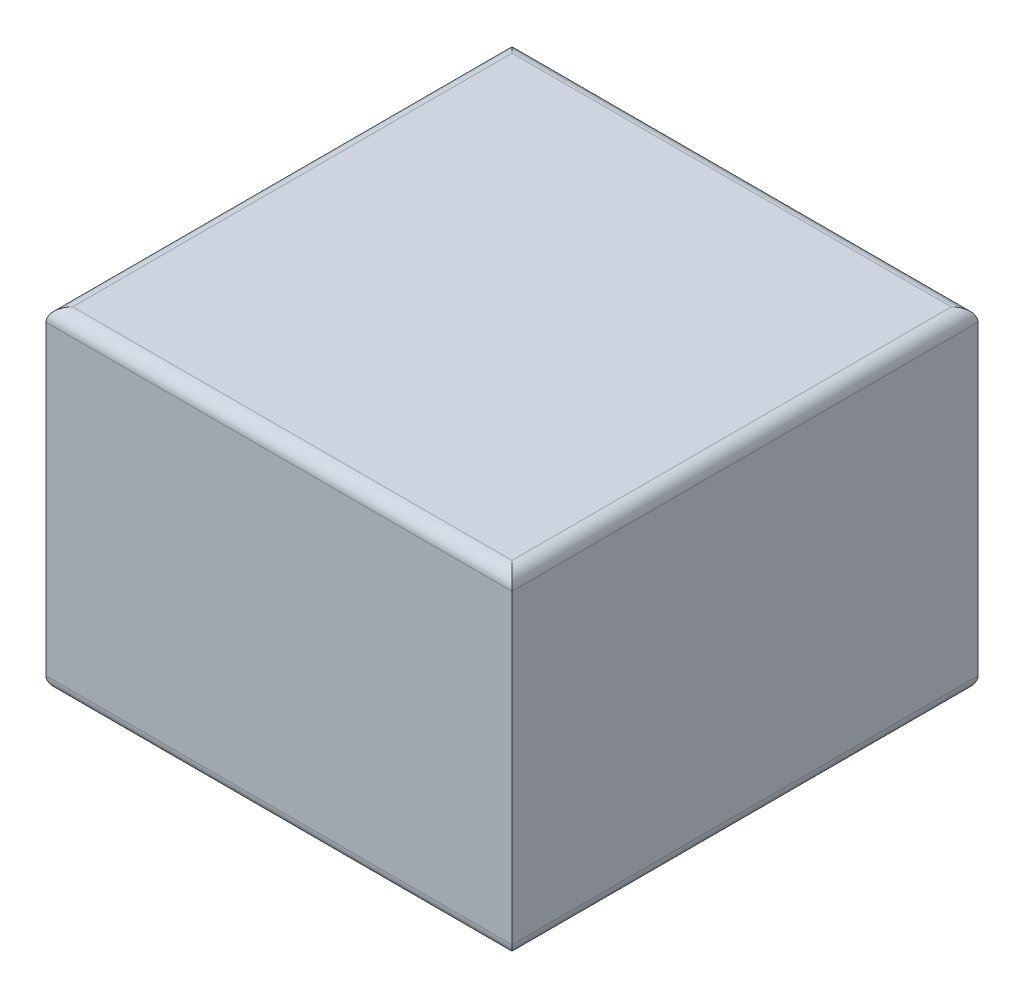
ISO-10303-21;
HEADER;
FILE_DESCRIPTION(('STEP AP214'),'2;1');
FILE_NAME('part.step','',(''),(''),'','','');
FILE_SCHEMA(('AUTOMOTIVE_DESIGN { 1 0 10303 214 1 1 1 1 }'));
ENDSEC;
DATA;
#1=APPLICATION_CONTEXT('core data for automotive mechanical design processes');
#2=APPLICATION_PROTOCOL_DEFINITION('international standard','automotive_design',2000,#1);
#3=PRODUCT_CONTEXT('',#1,'mechanical');
#4=PRODUCT('Part','Part','',(#3));
#5=PRODUCT_RELATED_PRODUCT_CATEGORY('part','',(#4));
#6=PRODUCT_DEFINITION_FORMATION('','',#4);
#7=PRODUCT_DEFINITION_CONTEXT('part definition',#1,'design');
#8=PRODUCT_DEFINITION('design','',#6,#7);
#9=PRODUCT_DEFINITION_SHAPE('','',#8);
#10=(LENGTH_UNIT() NAMED_UNIT(*) SI_UNIT(.MILLI.,.METRE.));
#11=(NAMED_UNIT(*) PLANE_ANGLE_UNIT() SI_UNIT($,.RADIAN.));
#12=(NAMED_UNIT(*) SI_UNIT($,.STERADIAN.) SOLID_ANGLE_UNIT());
#13=UNCERTAINTY_MEASURE_WITH_UNIT(LENGTH_MEASURE(1.E-05),#10,'distance_accuracy_value','');
#14=(GEOMETRIC_REPRESENTATION_CONTEXT(3) GLOBAL_UNCERTAINTY_ASSIGNED_CONTEXT((#13)) GLOBAL_UNIT_ASSIGNED_CONTEXT((#10,
#11,#12)) REPRESENTATION_CONTEXT('',''));
#15=CARTESIAN_POINT('',(0.,0.,0.));
#16=DIRECTION('',(0.,0.,1.));
#17=DIRECTION('',(1.,0.,0.));
#18=AXIS2_PLACEMENT_3D('',#15,#16,#17);
#19=CARTESIAN_POINT('',(0.,25.,0.));
#20=DIRECTION('',(1.,0.,0.));
#21=DIRECTION('',(0.,0.,-1.));
#22=AXIS2_PLACEMENT_3D('',#19,#20,#21);
#23=PLANE('',#22);
#24=DIRECTION('',(0.,-1.,0.));
#25=VECTOR('',#24,1.);
#26=CARTESIAN_POINT('',(0.,25.,-35.));
#27=LINE('',#26,#25);
#28=CARTESIAN_POINT('',(0.,24.,-35.));
#29=VERTEX_POINT('',#28);
#30=CARTESIAN_POINT('',(0.,1.,-35.));
#31=VERTEX_POINT('',#30);
#32=EDGE_CURVE('E158',#29,#31,#27,.T.);
#33=ORIENTED_EDGE('',*,*,#32,.T.);
#34=DIRECTION('',(0.,0.,1.));
#35=VECTOR('',#34,1.);
#36=CARTESIAN_POINT('',(0.,1.,0.));
#37=LINE('',#36,#35);
#38=CARTESIAN_POINT('',(0.,1.,0.));
#39=VERTEX_POINT('',#38);
#40=EDGE_CURVE('E172',#31,#39,#37,.T.);
#41=ORIENTED_EDGE('',*,*,#40,.T.);
#42=DIRECTION('',(0.,-1.,0.));
#43=VECTOR('',#42,1.);
#44=CARTESIAN_POINT('',(0.,25.,0.));
#45=LINE('',#44,#43);
#46=CARTESIAN_POINT('',(0.,24.,0.));
#47=VERTEX_POINT('',#46);
#48=EDGE_CURVE('E129',#47,#39,#45,.T.);
#49=ORIENTED_EDGE('',*,*,#48,.F.);
#50=DIRECTION('',(0.,0.,1.));
#51=VECTOR('',#50,1.);
#52=CARTESIAN_POINT('',(0.,24.,0.));
#53=LINE('',#52,#51);
#54=EDGE_CURVE('E175',#47,#29,#53,.F.);
#55=ORIENTED_EDGE('',*,*,#54,.T.);
#56=EDGE_LOOP('',(#33,#41,#49,#55));
#57=FACE_BOUND('',#56,.T.);
#58=ADVANCED_FACE('F39',(#57),#23,.F.);
#59=CARTESIAN_POINT('',(0.,25.,0.));
#60=DIRECTION('',(0.,0.,-1.));
#61=DIRECTION('',(-1.,0.,0.));
#62=AXIS2_PLACEMENT_3D('',#59,#60,#61);
#63=PLANE('',#62);
#64=ORIENTED_EDGE('',*,*,#48,.T.);
#65=DIRECTION('',(1.,0.,0.));
#66=VECTOR('',#65,1.);
#67=CARTESIAN_POINT('',(35.,1.,0.));
#68=LINE('',#67,#66);
#69=CARTESIAN_POINT('',(35.,1.,0.));
#70=VERTEX_POINT('',#69);
#71=EDGE_CURVE('E127',#39,#70,#68,.T.);
#72=ORIENTED_EDGE('',*,*,#71,.T.);
#73=DIRECTION('',(0.,-1.,0.));
#74=VECTOR('',#73,1.);
#75=CARTESIAN_POINT('',(35.,25.,0.));
#76=LINE('',#75,#74);
#77=CARTESIAN_POINT('',(35.,24.,0.));
#78=VERTEX_POINT('',#77);
#79=EDGE_CURVE('E109',#78,#70,#76,.T.);
#80=ORIENTED_EDGE('',*,*,#79,.F.);
#81=DIRECTION('',(1.,0.,0.));
#82=VECTOR('',#81,1.);
#83=CARTESIAN_POINT('',(0.,24.,0.));
#84=LINE('',#83,#82);
#85=EDGE_CURVE('E124',#78,#47,#84,.F.);
#86=ORIENTED_EDGE('',*,*,#85,.T.);
#87=EDGE_LOOP('',(#64,#72,#80,#86));
#88=FACE_BOUND('',#87,.T.);
#89=ADVANCED_FACE('F123',(#88),#63,.F.);
#90=CARTESIAN_POINT('',(35.,25.,0.));
#91=DIRECTION('',(-1.,0.,0.));
#92=DIRECTION('',(0.,0.,1.));
#93=AXIS2_PLACEMENT_3D('',#90,#91,#92);
#94=PLANE('',#93);
#95=ORIENTED_EDGE('',*,*,#79,.T.);
#96=DIRECTION('',(0.,0.,-1.));
#97=VECTOR('',#96,1.);
#98=CARTESIAN_POINT('',(35.,1.,-35.));
#99=LINE('',#98,#97);
#100=CARTESIAN_POINT('',(35.,1.,-35.));
#101=VERTEX_POINT('',#100);
#102=EDGE_CURVE('E116',#70,#101,#99,.T.);
#103=ORIENTED_EDGE('',*,*,#102,.T.);
#104=DIRECTION('',(0.,-1.,0.));
#105=VECTOR('',#104,1.);
#106=CARTESIAN_POINT('',(35.,25.,-35.));
#107=LINE('',#106,#105);
#108=CARTESIAN_POINT('',(35.,24.,-35.));
#109=VERTEX_POINT('',#108);
#110=EDGE_CURVE('E111',#109,#101,#107,.T.);
#111=ORIENTED_EDGE('',*,*,#110,.F.);
#112=DIRECTION('',(0.,0.,-1.));
#113=VECTOR('',#112,1.);
#114=CARTESIAN_POINT('',(35.,24.,0.));
#115=LINE('',#114,#113);
#116=EDGE_CURVE('E106',#109,#78,#115,.F.);
#117=ORIENTED_EDGE('',*,*,#116,.T.);
#118=EDGE_LOOP('',(#95,#103,#111,#117));
#119=FACE_BOUND('',#118,.T.);
#120=ADVANCED_FACE('F108',(#119),#94,.F.);
#121=CARTESIAN_POINT('',(0.,25.,-35.));
#122=DIRECTION('',(0.,0.,1.));
#123=DIRECTION('',(1.,0.,0.));
#124=AXIS2_PLACEMENT_3D('',#121,#122,#123);
#125=PLANE('',#124);
#126=ORIENTED_EDGE('',*,*,#110,.T.);
#127=DIRECTION('',(-1.,0.,0.));
#128=VECTOR('',#127,1.);
#129=CARTESIAN_POINT('',(0.,1.,-35.));
#130=LINE('',#129,#128);
#131=EDGE_CURVE('E178',#101,#31,#130,.T.);
#132=ORIENTED_EDGE('',*,*,#131,.T.);
#133=ORIENTED_EDGE('',*,*,#32,.F.);
#134=DIRECTION('',(-1.,0.,0.));
#135=VECTOR('',#134,1.);
#136=CARTESIAN_POINT('',(0.,24.,-35.));
#137=LINE('',#136,#135);
#138=EDGE_CURVE('E181',#29,#109,#137,.F.);
#139=ORIENTED_EDGE('',*,*,#138,.T.);
#140=EDGE_LOOP('',(#126,#132,#133,#139));
#141=FACE_BOUND('',#140,.T.);
#142=ADVANCED_FACE('F229',(#141),#125,.F.);
#143=CARTESIAN_POINT('',(0.,25.,0.));
#144=DIRECTION('',(0.,-1.,0.));
#145=DIRECTION('',(0.,0.,-1.));
#146=AXIS2_PLACEMENT_3D('',#143,#144,#145);
#147=PLANE('',#146);
#148=DIRECTION('',(0.,0.,-1.));
#149=VECTOR('',#148,1.);
#150=CARTESIAN_POINT('',(34.,25.,0.));
#151=LINE('',#150,#149);
#152=CARTESIAN_POINT('',(34.,25.,-1.));
#153=VERTEX_POINT('',#152);
#154=CARTESIAN_POINT('',(34.,25.,-34.));
#155=VERTEX_POINT('',#154);
#156=EDGE_CURVE('E49',#153,#155,#151,.T.);
#157=ORIENTED_EDGE('',*,*,#156,.T.);
#158=DIRECTION('',(-1.,0.,0.));
#159=VECTOR('',#158,1.);
#160=CARTESIAN_POINT('',(0.,25.,-34.));
#161=LINE('',#160,#159);
#162=CARTESIAN_POINT('',(1.,25.,-34.));
#163=VERTEX_POINT('',#162);
#164=EDGE_CURVE('E11',#155,#163,#161,.T.);
#165=ORIENTED_EDGE('',*,*,#164,.T.);
#166=DIRECTION('',(0.,0.,1.));
#167=VECTOR('',#166,1.);
#168=CARTESIAN_POINT('',(1.,25.,0.));
#169=LINE('',#168,#167);
#170=CARTESIAN_POINT('',(1.,25.,-1.));
#171=VERTEX_POINT('',#170);
#172=EDGE_CURVE('E169',#163,#171,#169,.T.);
#173=ORIENTED_EDGE('',*,*,#172,.T.);
#174=DIRECTION('',(1.,0.,0.));
#175=VECTOR('',#174,1.);
#176=CARTESIAN_POINT('',(0.,25.,-1.));
#177=LINE('',#176,#175);
#178=EDGE_CURVE('E60',#171,#153,#177,.T.);
#179=ORIENTED_EDGE('',*,*,#178,.T.);
#180=EDGE_LOOP('',(#157,#165,#173,#179));
#181=FACE_BOUND('',#180,.T.);
#182=ADVANCED_FACE('F235',(#181),#147,.F.);
#183=CARTESIAN_POINT('',(0.,0.,0.));
#184=DIRECTION('',(0.,-1.,0.));
#185=DIRECTION('',(0.,0.,-1.));
#186=AXIS2_PLACEMENT_3D('',#183,#184,#185);
#187=PLANE('',#186);
#188=DIRECTION('',(0.,0.,-1.));
#189=VECTOR('',#188,1.);
#190=CARTESIAN_POINT('',(34.,0.,0.));
#191=LINE('',#190,#189);
#192=CARTESIAN_POINT('',(34.,0.,-34.));
#193=VERTEX_POINT('',#192);
#194=CARTESIAN_POINT('',(34.,0.,-1.));
#195=VERTEX_POINT('',#194);
#196=EDGE_CURVE('E189',#193,#195,#191,.F.);
#197=ORIENTED_EDGE('',*,*,#196,.T.);
#198=DIRECTION('',(1.,0.,0.));
#199=VECTOR('',#198,1.);
#200=CARTESIAN_POINT('',(0.,0.,-1.));
#201=LINE('',#200,#199);
#202=CARTESIAN_POINT('',(1.,0.,-1.));
#203=VERTEX_POINT('',#202);
#204=EDGE_CURVE('E117',#195,#203,#201,.F.);
#205=ORIENTED_EDGE('',*,*,#204,.T.);
#206=DIRECTION('',(0.,0.,1.));
#207=VECTOR('',#206,1.);
#208=CARTESIAN_POINT('',(1.,0.,-35.));
#209=LINE('',#208,#207);
#210=CARTESIAN_POINT('',(1.,0.,-34.));
#211=VERTEX_POINT('',#210);
#212=EDGE_CURVE('E195',#203,#211,#209,.F.);
#213=ORIENTED_EDGE('',*,*,#212,.T.);
#214=DIRECTION('',(-1.,0.,0.));
#215=VECTOR('',#214,1.);
#216=CARTESIAN_POINT('',(35.,0.,-34.));
#217=LINE('',#216,#215);
#218=EDGE_CURVE('E192',#211,#193,#217,.F.);
#219=ORIENTED_EDGE('',*,*,#218,.T.);
#220=EDGE_LOOP('',(#197,#205,#213,#219));
#221=FACE_BOUND('',#220,.T.);
#222=ADVANCED_FACE('F237',(#221),#187,.T.);
#223=CARTESIAN_POINT('',(0.,1.,-34.));
#224=DIRECTION('',(1.,0.,0.));
#225=DIRECTION('',(0.,0.,-1.));
#226=AXIS2_PLACEMENT_3D('',#223,#224,#225);
#227=CYLINDRICAL_SURFACE('',#226,1.);
#228=CARTESIAN_POINT('',(34.,1.,-34.));
#229=DIRECTION('',(0.707106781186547,0.,0.707106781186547));
#230=DIRECTION('',(0.707106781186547,0.,-0.707106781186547));
#231=AXIS2_PLACEMENT_3D('',#228,#229,#230);
#232=ELLIPSE('',#231,1.41421356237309,1.);
#233=EDGE_CURVE('E159',#193,#101,#232,.T.);
#234=ORIENTED_EDGE('',*,*,#233,.F.);
#235=ORIENTED_EDGE('',*,*,#218,.F.);
#236=CARTESIAN_POINT('',(1.,1.,-34.));
#237=DIRECTION('',(0.707106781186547,0.,-0.707106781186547));
#238=DIRECTION('',(-0.707106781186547,0.,-0.707106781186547));
#239=AXIS2_PLACEMENT_3D('',#236,#237,#238);
#240=ELLIPSE('',#239,1.41421356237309,1.);
#241=EDGE_CURVE('E154',#31,#211,#240,.F.);
#242=ORIENTED_EDGE('',*,*,#241,.F.);
#243=ORIENTED_EDGE('',*,*,#131,.F.);
#244=EDGE_LOOP('',(#234,#235,#242,#243));
#245=FACE_BOUND('',#244,.T.);
#246=ADVANCED_FACE('F216',(#245),#227,.T.);
#247=CARTESIAN_POINT('',(1.,1.,0.));
#248=DIRECTION('',(0.,0.,-1.));
#249=DIRECTION('',(-1.,0.,0.));
#250=AXIS2_PLACEMENT_3D('',#247,#248,#249);
#251=CYLINDRICAL_SURFACE('',#250,1.);
#252=ORIENTED_EDGE('',*,*,#241,.T.);
#253=ORIENTED_EDGE('',*,*,#212,.F.);
#254=CARTESIAN_POINT('',(1.,1.,-1.));
#255=DIRECTION('',(-0.707106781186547,0.,-0.707106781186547));
#256=DIRECTION('',(0.707106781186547,0.,-0.707106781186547));
#257=AXIS2_PLACEMENT_3D('',#254,#255,#256);
#258=ELLIPSE('',#257,1.41421356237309,1.);
#259=EDGE_CURVE('E143',#39,#203,#258,.F.);
#260=ORIENTED_EDGE('',*,*,#259,.F.);
#261=ORIENTED_EDGE('',*,*,#40,.F.);
#262=EDGE_LOOP('',(#252,#253,#260,#261));
#263=FACE_BOUND('',#262,.T.);
#264=ADVANCED_FACE('F220',(#263),#251,.T.);
#265=CARTESIAN_POINT('',(34.,1.,0.));
#266=DIRECTION('',(0.,0.,1.));
#267=DIRECTION('',(1.,0.,0.));
#268=AXIS2_PLACEMENT_3D('',#265,#266,#267);
#269=CYLINDRICAL_SURFACE('',#268,1.);
#270=ORIENTED_EDGE('',*,*,#233,.T.);
#271=ORIENTED_EDGE('',*,*,#102,.F.);
#272=CARTESIAN_POINT('',(34.,1.,-1.));
#273=DIRECTION('',(-0.707106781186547,0.,0.707106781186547));
#274=DIRECTION('',(0.707106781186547,0.,0.707106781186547));
#275=AXIS2_PLACEMENT_3D('',#272,#273,#274);
#276=ELLIPSE('',#275,1.41421356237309,1.);
#277=EDGE_CURVE('E140',#195,#70,#276,.T.);
#278=ORIENTED_EDGE('',*,*,#277,.F.);
#279=ORIENTED_EDGE('',*,*,#196,.F.);
#280=EDGE_LOOP('',(#270,#271,#278,#279));
#281=FACE_BOUND('',#280,.T.);
#282=ADVANCED_FACE('F228',(#281),#269,.T.);
#283=CARTESIAN_POINT('',(0.,1.,-1.));
#284=DIRECTION('',(-1.,0.,0.));
#285=DIRECTION('',(0.,0.,1.));
#286=AXIS2_PLACEMENT_3D('',#283,#284,#285);
#287=CYLINDRICAL_SURFACE('',#286,1.);
#288=ORIENTED_EDGE('',*,*,#259,.T.);
#289=ORIENTED_EDGE('',*,*,#204,.F.);
#290=ORIENTED_EDGE('',*,*,#277,.T.);
#291=ORIENTED_EDGE('',*,*,#71,.F.);
#292=EDGE_LOOP('',(#288,#289,#290,#291));
#293=FACE_BOUND('',#292,.T.);
#294=ADVANCED_FACE('F223',(#293),#287,.T.);
#295=CARTESIAN_POINT('',(0.,24.,-1.));
#296=DIRECTION('',(1.,0.,0.));
#297=DIRECTION('',(0.,0.,-1.));
#298=AXIS2_PLACEMENT_3D('',#295,#296,#297);
#299=CYLINDRICAL_SURFACE('',#298,1.);
#300=CARTESIAN_POINT('',(1.,24.,-1.));
#301=DIRECTION('',(0.707106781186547,0.,0.707106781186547));
#302=DIRECTION('',(-0.707106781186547,0.,0.707106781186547));
#303=AXIS2_PLACEMENT_3D('',#300,#301,#302);
#304=ELLIPSE('',#303,1.41421356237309,1.);
#305=EDGE_CURVE('E134',#47,#171,#304,.F.);
#306=ORIENTED_EDGE('',*,*,#305,.F.);
#307=ORIENTED_EDGE('',*,*,#85,.F.);
#308=CARTESIAN_POINT('',(34.,24.,-1.));
#309=DIRECTION('',(0.707106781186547,0.,-0.707106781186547));
#310=DIRECTION('',(0.707106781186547,0.,0.707106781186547));
#311=AXIS2_PLACEMENT_3D('',#308,#309,#310);
#312=ELLIPSE('',#311,1.41421356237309,1.);
#313=EDGE_CURVE('E43',#153,#78,#312,.T.);
#314=ORIENTED_EDGE('',*,*,#313,.F.);
#315=ORIENTED_EDGE('',*,*,#178,.F.);
#316=EDGE_LOOP('',(#306,#307,#314,#315));
#317=FACE_BOUND('',#316,.T.);
#318=ADVANCED_FACE('F41',(#317),#299,.T.);
#319=CARTESIAN_POINT('',(34.,24.,0.));
#320=DIRECTION('',(0.,0.,-1.));
#321=DIRECTION('',(-1.,0.,0.));
#322=AXIS2_PLACEMENT_3D('',#319,#320,#321);
#323=CYLINDRICAL_SURFACE('',#322,1.);
#324=ORIENTED_EDGE('',*,*,#313,.T.);
#325=ORIENTED_EDGE('',*,*,#116,.F.);
#326=CARTESIAN_POINT('',(34.,24.,-34.));
#327=DIRECTION('',(-0.707106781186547,0.,-0.707106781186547));
#328=DIRECTION('',(0.707106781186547,0.,-0.707106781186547));
#329=AXIS2_PLACEMENT_3D('',#326,#327,#328);
#330=ELLIPSE('',#329,1.41421356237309,1.);
#331=EDGE_CURVE('E145',#155,#109,#330,.T.);
#332=ORIENTED_EDGE('',*,*,#331,.F.);
#333=ORIENTED_EDGE('',*,*,#156,.F.);
#334=EDGE_LOOP('',(#324,#325,#332,#333));
#335=FACE_BOUND('',#334,.T.);
#336=ADVANCED_FACE('F138',(#335),#323,.T.);
#337=CARTESIAN_POINT('',(1.,24.,0.));
#338=DIRECTION('',(0.,0.,1.));
#339=DIRECTION('',(1.,0.,0.));
#340=AXIS2_PLACEMENT_3D('',#337,#338,#339);
#341=CYLINDRICAL_SURFACE('',#340,1.);
#342=ORIENTED_EDGE('',*,*,#305,.T.);
#343=ORIENTED_EDGE('',*,*,#172,.F.);
#344=CARTESIAN_POINT('',(1.,24.,-34.));
#345=DIRECTION('',(-0.707106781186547,0.,0.707106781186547));
#346=DIRECTION('',(0.707106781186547,0.,0.707106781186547));
#347=AXIS2_PLACEMENT_3D('',#344,#345,#346);
#348=ELLIPSE('',#347,1.41421356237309,1.);
#349=EDGE_CURVE('E149',#29,#163,#348,.F.);
#350=ORIENTED_EDGE('',*,*,#349,.F.);
#351=ORIENTED_EDGE('',*,*,#54,.F.);
#352=EDGE_LOOP('',(#342,#343,#350,#351));
#353=FACE_BOUND('',#352,.T.);
#354=ADVANCED_FACE('F234',(#353),#341,.T.);
#355=CARTESIAN_POINT('',(0.,24.,-34.));
#356=DIRECTION('',(-1.,0.,0.));
#357=DIRECTION('',(0.,0.,1.));
#358=AXIS2_PLACEMENT_3D('',#355,#356,#357);
#359=CYLINDRICAL_SURFACE('',#358,1.);
#360=ORIENTED_EDGE('',*,*,#331,.T.);
#361=ORIENTED_EDGE('',*,*,#138,.F.);
#362=ORIENTED_EDGE('',*,*,#349,.T.);
#363=ORIENTED_EDGE('',*,*,#164,.F.);
#364=EDGE_LOOP('',(#360,#361,#362,#363));
#365=FACE_BOUND('',#364,.T.);
#366=ADVANCED_FACE('F232',(#365),#359,.T.);
#367=CLOSED_SHELL('',(#58,#89,#120,#142,#182,#222,#246,#264,#282,#294,#318,#336,#354,#366));
#368=MANIFOLD_SOLID_BREP('B2',#367);
#369=ADVANCED_BREP_SHAPE_REPRESENTATION('',(#18,#368),#14);
#370=SHAPE_DEFINITION_REPRESENTATION(#9,#369);
ENDSEC;
END-ISO-10303-21;
